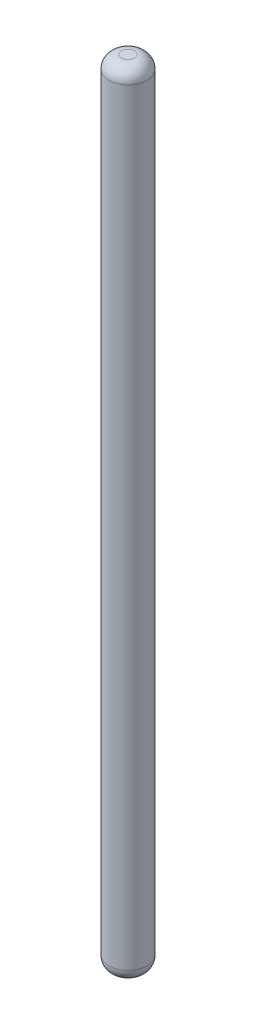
from build123d import *

# Parameters (mm, degrees)
SKETCH1_R           = 1.5
BOSS_EXTRUDE1_DEPTH = 62
FILLET1_R           = 1


with BuildPart() as part:
    # Sketch1 → Boss-Extrude1 (new body)
    with BuildSketch(Plane(origin=(0, 0, 0), x_dir=(1, 0, 0), z_dir=(0, 1, 0))):
        with Locations(Location((0, 0, 0), (0, 0, 270))):
            Circle(SKETCH1_R)
    extrude(amount=BOSS_EXTRUDE1_DEPTH)

    # Fillet1
    fillet1_edges = [part.edges().sort_by_distance(p)[0] for p in [
        (0, 0, -1.5),
        (0, 62, -1.5),
    ]]
    fillet(fillet1_edges, radius=FILLET1_R)


solid = part.part
